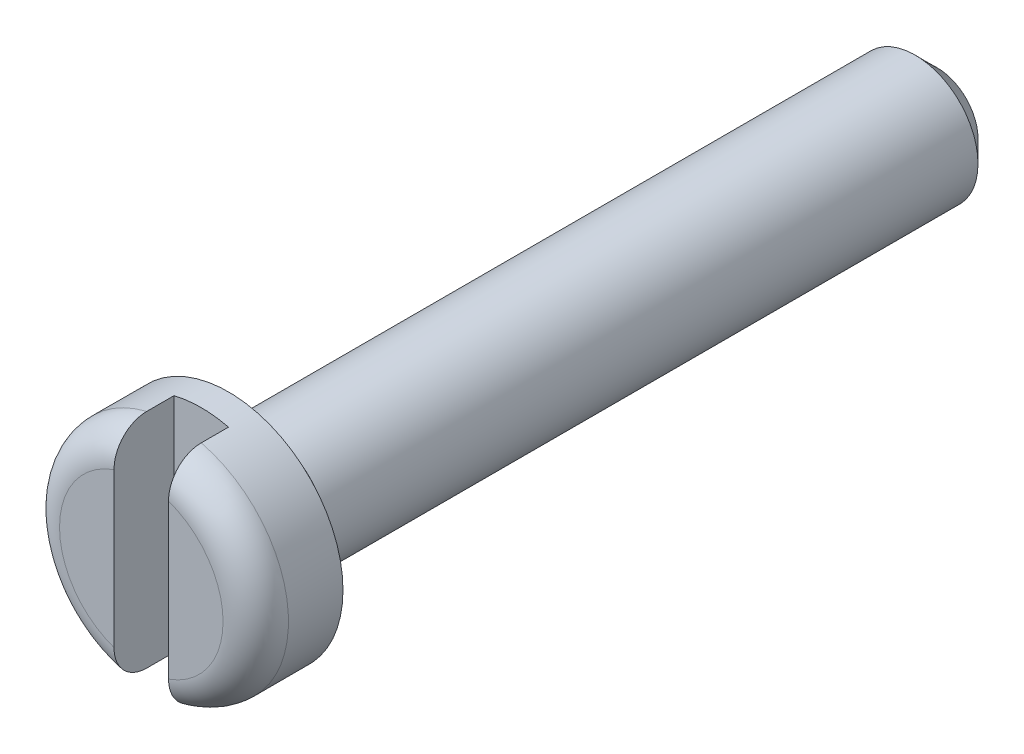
from build123d import *

# Parameters (mm, degrees)
ESQUISSE1_R             = 2.1
BASE_EXTRUSION_DEPTH    = 1.6
CONG_1_R                = 0.6
ESQUISSE2_R             = 1.15
BOSS_EXTRU_1_DEPTH      = 13
CHANFREIN1_SIZE         = 0.4
ESQUISSE4_W             = 1
ESQUISSE4_H             = 1.322682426
ENL_V_MAT_EXTRU_1_DEPTH = 3


with BuildPart() as part:
    # Esquisse1 → Base-Extrusion (new body)
    with BuildSketch(Plane.XY):
        Circle(ESQUISSE1_R)
    extrude(amount=BASE_EXTRUSION_DEPTH)

    # Cong_1
    cong_1_edges = [part.edges().sort_by_distance(p)[0] for p in [
        (-2.1, 0, 1.6),
    ]]
    fillet(cong_1_edges, radius=CONG_1_R)

    # Esquisse2 → Boss.-Extru.1 (add)
    with BuildSketch(Plane(origin=(0, 0, 0), x_dir=(-1, 0, 0), z_dir=(0, 0, -1))):
        with Locations(Location((0, 0, 0), (0, 0, 180))):
            Circle(ESQUISSE2_R)
    extrude(amount=BOSS_EXTRU_1_DEPTH)

    # Chanfrein1
    chanfrein1_edges = [part.edges().sort_by_distance(p)[0] for p in [
        (-1.15, 0, -13),
    ]]
    chamfer(chanfrein1_edges, length=CHANFREIN1_SIZE)

    # Esquisse3 → Enl_vement de mati_re-R_volution1 (revolve, cut)
    with BuildSketch(Plane(origin=(0, 0, 0), x_dir=(1, 0, 0), z_dir=(0, 1, 0))):
        Polygon((2.305619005, 0), (0.75, 0), (0.75, 0.211269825), (1.504326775, 1.085406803), align=None)
    revolve(axis=Axis((0, 0, 0.101807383), (0, 0, -1)), mode=Mode.SUBTRACT)

    # Esquisse4 → Enl_v. mat.-Extru.1 (cut, symmetric)
    with BuildSketch(Plane(origin=(0, 0, 0), x_dir=(1, 0, 0), z_dir=(0, 1, 0))):
        with Locations((0, -1.161341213)):
            Rectangle(ESQUISSE4_W, ESQUISSE4_H)
    extrude(amount=ENL_V_MAT_EXTRU_1_DEPTH, both=True, mode=Mode.SUBTRACT)


solid = part.part
